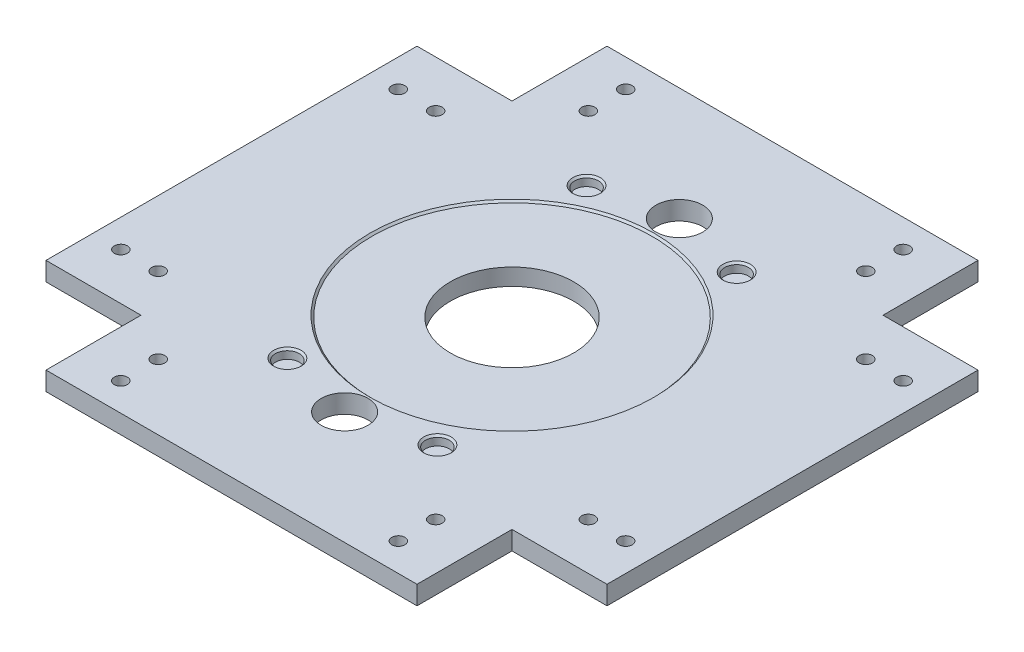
ISO-10303-21;
HEADER;
FILE_DESCRIPTION(('STEP AP214'),'2;1');
FILE_NAME('part.step','',(''),(''),'','','');
FILE_SCHEMA(('AUTOMOTIVE_DESIGN { 1 0 10303 214 1 1 1 1 }'));
ENDSEC;
DATA;
#1=APPLICATION_CONTEXT('core data for automotive mechanical design processes');
#2=APPLICATION_PROTOCOL_DEFINITION('international standard','automotive_design',2000,#1);
#3=PRODUCT_CONTEXT('',#1,'mechanical');
#4=PRODUCT('Part','Part','',(#3));
#5=PRODUCT_RELATED_PRODUCT_CATEGORY('part','',(#4));
#6=PRODUCT_DEFINITION_FORMATION('','',#4);
#7=PRODUCT_DEFINITION_CONTEXT('part definition',#1,'design');
#8=PRODUCT_DEFINITION('design','',#6,#7);
#9=PRODUCT_DEFINITION_SHAPE('','',#8);
#10=(LENGTH_UNIT() NAMED_UNIT(*) SI_UNIT(.MILLI.,.METRE.));
#11=(NAMED_UNIT(*) PLANE_ANGLE_UNIT() SI_UNIT($,.RADIAN.));
#12=(NAMED_UNIT(*) SI_UNIT($,.STERADIAN.) SOLID_ANGLE_UNIT());
#13=UNCERTAINTY_MEASURE_WITH_UNIT(LENGTH_MEASURE(1.E-05),#10,'distance_accuracy_value','');
#14=(GEOMETRIC_REPRESENTATION_CONTEXT(3) GLOBAL_UNCERTAINTY_ASSIGNED_CONTEXT((#13)) GLOBAL_UNIT_ASSIGNED_CONTEXT((#10,
#11,#12)) REPRESENTATION_CONTEXT('',''));
#15=CARTESIAN_POINT('',(0.,0.,0.));
#16=DIRECTION('',(0.,0.,1.));
#17=DIRECTION('',(1.,0.,0.));
#18=AXIS2_PLACEMENT_3D('',#15,#16,#17);
#19=CARTESIAN_POINT('',(0.,10.,0.));
#20=DIRECTION('',(0.,-1.,0.));
#21=DIRECTION('',(0.,0.,-1.));
#22=AXIS2_PLACEMENT_3D('',#19,#20,#21);
#23=CYLINDRICAL_SURFACE('',#22,33.);
#24=CARTESIAN_POINT('',(0.,0.,0.));
#25=DIRECTION('',(0.,1.,0.));
#26=DIRECTION('',(0.,0.,1.));
#27=AXIS2_PLACEMENT_3D('',#24,#25,#26);
#28=CIRCLE('',#27,33.);
#29=CARTESIAN_POINT('',(0.,0.,33.));
#30=VERTEX_POINT('',#29);
#31=EDGE_CURVE('E169',#30,#30,#28,.T.);
#32=ORIENTED_EDGE('',*,*,#31,.F.);
#33=EDGE_LOOP('',(#32));
#34=FACE_BOUND('',#33,.T.);
#35=CARTESIAN_POINT('',(0.,9.,0.));
#36=DIRECTION('',(0.,1.,0.));
#37=DIRECTION('',(0.,0.,1.));
#38=AXIS2_PLACEMENT_3D('',#35,#36,#37);
#39=CIRCLE('',#38,33.);
#40=CARTESIAN_POINT('',(0.,9.,33.));
#41=VERTEX_POINT('',#40);
#42=EDGE_CURVE('E237',#41,#41,#39,.T.);
#43=ORIENTED_EDGE('',*,*,#42,.T.);
#44=EDGE_LOOP('',(#43));
#45=FACE_BOUND('',#44,.T.);
#46=ADVANCED_FACE('F41',(#34,#45),#23,.F.);
#47=CARTESIAN_POINT('',(0.,10.,0.));
#48=DIRECTION('',(0.,-1.,0.));
#49=DIRECTION('',(0.,0.,-1.));
#50=AXIS2_PLACEMENT_3D('',#47,#48,#49);
#51=PLANE('',#50);
#52=CARTESIAN_POINT('',(-114.999999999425,10.,-74.1999999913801));
#53=DIRECTION('',(0.,1.,0.));
#54=DIRECTION('',(0.,0.,1.));
#55=AXIS2_PLACEMENT_3D('',#52,#53,#54);
#56=CIRCLE('',#55,3.49999999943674);
#57=CARTESIAN_POINT('',(-114.999999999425,10.,-70.6999999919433));
#58=VERTEX_POINT('',#57);
#59=EDGE_CURVE('E558',#58,#58,#56,.T.);
#60=ORIENTED_EDGE('',*,*,#59,.F.);
#61=EDGE_LOOP('',(#60));
#62=FACE_BOUND('',#61,.T.);
#63=CARTESIAN_POINT('',(-74.1999999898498,10.,-115.000000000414));
#64=DIRECTION('',(0.,1.,0.));
#65=DIRECTION('',(0.,0.,1.));
#66=AXIS2_PLACEMENT_3D('',#63,#64,#65);
#67=CIRCLE('',#66,3.49999999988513);
#68=CARTESIAN_POINT('',(-74.1999999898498,10.,-111.500000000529));
#69=VERTEX_POINT('',#68);
#70=EDGE_CURVE('E562',#69,#69,#67,.T.);
#71=ORIENTED_EDGE('',*,*,#70,.F.);
#72=EDGE_LOOP('',(#71));
#73=FACE_BOUND('',#72,.T.);
#74=CARTESIAN_POINT('',(74.1999999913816,10.,-114.99999999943));
#75=DIRECTION('',(0.,1.,0.));
#76=DIRECTION('',(0.,0.,1.));
#77=AXIS2_PLACEMENT_3D('',#74,#75,#76);
#78=CIRCLE('',#77,3.49999999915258);
#79=CARTESIAN_POINT('',(74.1999999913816,10.,-111.500000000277));
#80=VERTEX_POINT('',#79);
#81=EDGE_CURVE('E566',#80,#80,#78,.T.);
#82=ORIENTED_EDGE('',*,*,#81,.F.);
#83=EDGE_LOOP('',(#82));
#84=FACE_BOUND('',#83,.T.);
#85=CARTESIAN_POINT('',(74.1999999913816,10.,-134.99999999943));
#86=DIRECTION('',(0.,1.,0.));
#87=DIRECTION('',(0.,0.,1.));
#88=AXIS2_PLACEMENT_3D('',#85,#86,#87);
#89=CIRCLE('',#88,3.49999999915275);
#90=CARTESIAN_POINT('',(74.1999999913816,10.,-131.500000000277));
#91=VERTEX_POINT('',#90);
#92=EDGE_CURVE('E570',#91,#91,#89,.T.);
#93=ORIENTED_EDGE('',*,*,#92,.F.);
#94=EDGE_LOOP('',(#93));
#95=FACE_BOUND('',#94,.T.);
#96=CARTESIAN_POINT('',(115.000000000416,10.,-74.1999999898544));
#97=DIRECTION('',(0.,1.,0.));
#98=DIRECTION('',(0.,0.,1.));
#99=AXIS2_PLACEMENT_3D('',#96,#97,#98);
#100=CIRCLE('',#99,3.49999999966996);
#101=CARTESIAN_POINT('',(115.000000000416,10.,-70.6999999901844));
#102=VERTEX_POINT('',#101);
#103=EDGE_CURVE('E574',#102,#102,#100,.T.);
#104=ORIENTED_EDGE('',*,*,#103,.F.);
#105=EDGE_LOOP('',(#104));
#106=FACE_BOUND('',#105,.T.);
#107=CARTESIAN_POINT('',(135.000000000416,10.,-74.199999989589));
#108=DIRECTION('',(0.,1.,0.));
#109=DIRECTION('',(0.,0.,1.));
#110=AXIS2_PLACEMENT_3D('',#107,#108,#109);
#111=CIRCLE('',#110,3.49999999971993);
#112=CARTESIAN_POINT('',(135.000000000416,10.,-70.6999999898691));
#113=VERTEX_POINT('',#112);
#114=EDGE_CURVE('E530',#113,#113,#111,.T.);
#115=ORIENTED_EDGE('',*,*,#114,.F.);
#116=EDGE_LOOP('',(#115));
#117=FACE_BOUND('',#116,.T.);
#118=CARTESIAN_POINT('',(74.1999999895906,10.,135.000000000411));
#119=DIRECTION('',(0.,1.,0.));
#120=DIRECTION('',(0.,0.,1.));
#121=AXIS2_PLACEMENT_3D('',#118,#119,#120);
#122=CIRCLE('',#121,3.50000000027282);
#123=CARTESIAN_POINT('',(74.1999999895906,10.,138.500000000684));
#124=VERTEX_POINT('',#123);
#125=EDGE_CURVE('E527',#124,#124,#122,.T.);
#126=ORIENTED_EDGE('',*,*,#125,.F.);
#127=EDGE_LOOP('',(#126));
#128=FACE_BOUND('',#127,.T.);
#129=CARTESIAN_POINT('',(74.199999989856,10.,115.000000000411));
#130=DIRECTION('',(0.,1.,0.));
#131=DIRECTION('',(0.,0.,1.));
#132=AXIS2_PLACEMENT_3D('',#129,#130,#131);
#133=CIRCLE('',#132,3.50000000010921);
#134=CARTESIAN_POINT('',(74.199999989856,10.,118.50000000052));
#135=VERTEX_POINT('',#134);
#136=EDGE_CURVE('E532',#135,#135,#133,.T.);
#137=ORIENTED_EDGE('',*,*,#136,.F.);
#138=EDGE_LOOP('',(#137));
#139=FACE_BOUND('',#138,.T.);
#140=CARTESIAN_POINT('',(-74.1999999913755,10.,114.999999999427));
#141=DIRECTION('',(0.,1.,0.));
#142=DIRECTION('',(0.,0.,1.));
#143=AXIS2_PLACEMENT_3D('',#140,#141,#142);
#144=CIRCLE('',#143,3.50000000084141);
#145=CARTESIAN_POINT('',(-74.1999999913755,10.,118.500000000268));
#146=VERTEX_POINT('',#145);
#147=EDGE_CURVE('E538',#146,#146,#144,.T.);
#148=ORIENTED_EDGE('',*,*,#147,.F.);
#149=EDGE_LOOP('',(#148));
#150=FACE_BOUND('',#149,.T.);
#151=CARTESIAN_POINT('',(-74.1999999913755,10.,134.999999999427));
#152=DIRECTION('',(0.,1.,0.));
#153=DIRECTION('',(0.,0.,1.));
#154=AXIS2_PLACEMENT_3D('',#151,#152,#153);
#155=CIRCLE('',#154,3.50000000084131);
#156=CARTESIAN_POINT('',(-74.1999999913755,10.,138.500000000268));
#157=VERTEX_POINT('',#156);
#158=EDGE_CURVE('E542',#157,#157,#155,.T.);
#159=ORIENTED_EDGE('',*,*,#158,.F.);
#160=EDGE_LOOP('',(#159));
#161=FACE_BOUND('',#160,.T.);
#162=CARTESIAN_POINT('',(-115.000000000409,10.,74.1999999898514));
#163=DIRECTION('',(0.,1.,0.));
#164=DIRECTION('',(0.,0.,1.));
#165=AXIS2_PLACEMENT_3D('',#162,#163,#164);
#166=CIRCLE('',#165,3.50000000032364);
#167=CARTESIAN_POINT('',(-115.000000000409,10.,77.699999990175));
#168=VERTEX_POINT('',#167);
#169=EDGE_CURVE('E546',#168,#168,#166,.T.);
#170=ORIENTED_EDGE('',*,*,#169,.F.);
#171=EDGE_LOOP('',(#170));
#172=FACE_BOUND('',#171,.T.);
#173=CARTESIAN_POINT('',(-135.000000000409,10.,74.1999999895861));
#174=DIRECTION('',(0.,1.,0.));
#175=DIRECTION('',(0.,0.,1.));
#176=AXIS2_PLACEMENT_3D('',#173,#174,#175);
#177=CIRCLE('',#176,3.50000000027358);
#178=CARTESIAN_POINT('',(-135.000000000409,10.,77.6999999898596));
#179=VERTEX_POINT('',#178);
#180=EDGE_CURVE('E550',#179,#179,#177,.T.);
#181=ORIENTED_EDGE('',*,*,#180,.F.);
#182=EDGE_LOOP('',(#181));
#183=FACE_BOUND('',#182,.T.);
#184=CARTESIAN_POINT('',(-74.1999999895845,10.,-135.000000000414));
#185=DIRECTION('',(0.,1.,0.));
#186=DIRECTION('',(0.,0.,1.));
#187=AXIS2_PLACEMENT_3D('',#184,#185,#186);
#188=CIRCLE('',#187,3.49999999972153);
#189=CARTESIAN_POINT('',(-74.1999999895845,10.,-131.500000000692));
#190=VERTEX_POINT('',#189);
#191=EDGE_CURVE('E554',#190,#190,#188,.T.);
#192=ORIENTED_EDGE('',*,*,#191,.F.);
#193=EDGE_LOOP('',(#192));
#194=FACE_BOUND('',#193,.T.);
#195=CARTESIAN_POINT('',(-134.999999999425,10.,-74.1999999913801));
#196=DIRECTION('',(0.,1.,0.));
#197=DIRECTION('',(0.,0.,1.));
#198=AXIS2_PLACEMENT_3D('',#195,#196,#197);
#199=CIRCLE('',#198,3.4999999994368);
#200=CARTESIAN_POINT('',(-134.999999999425,10.,-70.6999999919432));
#201=VERTEX_POINT('',#200);
#202=EDGE_CURVE('E252',#201,#201,#199,.T.);
#203=ORIENTED_EDGE('',*,*,#202,.F.);
#204=EDGE_LOOP('',(#203));
#205=FACE_BOUND('',#204,.T.);
#206=CARTESIAN_POINT('',(0.,10.,0.));
#207=DIRECTION('',(0.,-1.,0.));
#208=DIRECTION('',(0.,0.,-1.));
#209=AXIS2_PLACEMENT_3D('',#206,#207,#208);
#210=CIRCLE('',#209,76.);
#211=CARTESIAN_POINT('',(0.,10.,-76.));
#212=VERTEX_POINT('',#211);
#213=EDGE_CURVE('E11',#212,#212,#210,.T.);
#214=ORIENTED_EDGE('',*,*,#213,.T.);
#215=EDGE_LOOP('',(#214));
#216=FACE_BOUND('',#215,.T.);
#217=CARTESIAN_POINT('',(40.1279204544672,10.,-79.9999999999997));
#218=DIRECTION('',(0.,-1.,0.));
#219=DIRECTION('',(0.,0.,-1.));
#220=AXIS2_PLACEMENT_3D('',#217,#218,#219);
#221=CIRCLE('',#220,7.34999999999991);
#222=CARTESIAN_POINT('',(40.1279204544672,10.,-87.3499999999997));
#223=VERTEX_POINT('',#222);
#224=EDGE_CURVE('E227',#223,#223,#221,.T.);
#225=ORIENTED_EDGE('',*,*,#224,.T.);
#226=EDGE_LOOP('',(#225));
#227=FACE_BOUND('',#226,.T.);
#228=CARTESIAN_POINT('',(-40.1279204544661,10.,-80.0000000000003));
#229=DIRECTION('',(0.,-1.,0.));
#230=DIRECTION('',(0.,0.,-1.));
#231=AXIS2_PLACEMENT_3D('',#228,#229,#230);
#232=CIRCLE('',#231,7.34999999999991);
#233=CARTESIAN_POINT('',(-40.1279204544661,10.,-87.3500000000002));
#234=VERTEX_POINT('',#233);
#235=EDGE_CURVE('E224',#234,#234,#232,.T.);
#236=ORIENTED_EDGE('',*,*,#235,.T.);
#237=EDGE_LOOP('',(#236));
#238=FACE_BOUND('',#237,.T.);
#239=CARTESIAN_POINT('',(40.1279204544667,10.,80.));
#240=DIRECTION('',(0.,-1.,0.));
#241=DIRECTION('',(0.,0.,-1.));
#242=AXIS2_PLACEMENT_3D('',#239,#240,#241);
#243=CIRCLE('',#242,7.34999999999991);
#244=CARTESIAN_POINT('',(40.1279204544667,10.,72.6500000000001));
#245=VERTEX_POINT('',#244);
#246=EDGE_CURVE('E221',#245,#245,#243,.T.);
#247=ORIENTED_EDGE('',*,*,#246,.T.);
#248=EDGE_LOOP('',(#247));
#249=FACE_BOUND('',#248,.T.);
#250=CARTESIAN_POINT('',(-40.1279204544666,10.,80.));
#251=DIRECTION('',(0.,-1.,0.));
#252=DIRECTION('',(0.,0.,-1.));
#253=AXIS2_PLACEMENT_3D('',#250,#251,#252);
#254=CIRCLE('',#253,7.34999999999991);
#255=CARTESIAN_POINT('',(-40.1279204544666,10.,72.6500000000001));
#256=VERTEX_POINT('',#255);
#257=EDGE_CURVE('E218',#256,#256,#254,.T.);
#258=ORIENTED_EDGE('',*,*,#257,.T.);
#259=EDGE_LOOP('',(#258));
#260=FACE_BOUND('',#259,.T.);
#261=CARTESIAN_POINT('',(134.999999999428,10.,74.1999999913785));
#262=DIRECTION('',(0.,1.,0.));
#263=DIRECTION('',(0.,0.,1.));
#264=AXIS2_PLACEMENT_3D('',#261,#262,#263);
#265=CIRCLE('',#264,3.50000000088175);
#266=CARTESIAN_POINT('',(134.999999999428,10.,77.6999999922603));
#267=VERTEX_POINT('',#266);
#268=EDGE_CURVE('E269',#267,#267,#265,.T.);
#269=ORIENTED_EDGE('',*,*,#268,.F.);
#270=EDGE_LOOP('',(#269));
#271=FACE_BOUND('',#270,.T.);
#272=CARTESIAN_POINT('',(114.999999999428,10.,74.1999999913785));
#273=DIRECTION('',(0.,1.,0.));
#274=DIRECTION('',(0.,0.,1.));
#275=AXIS2_PLACEMENT_3D('',#272,#273,#274);
#276=CIRCLE('',#275,3.50000000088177);
#277=CARTESIAN_POINT('',(114.999999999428,10.,77.6999999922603));
#278=VERTEX_POINT('',#277);
#279=EDGE_CURVE('E272',#278,#278,#276,.T.);
#280=ORIENTED_EDGE('',*,*,#279,.F.);
#281=EDGE_LOOP('',(#280));
#282=FACE_BOUND('',#281,.T.);
#283=DIRECTION('',(0.,0.,1.));
#284=VECTOR('',#283,1.);
#285=CARTESIAN_POINT('',(-99.2,10.,150.));
#286=LINE('',#285,#284);
#287=CARTESIAN_POINT('',(-99.2,10.,99.2000000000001));
#288=VERTEX_POINT('',#287);
#289=CARTESIAN_POINT('',(-99.2,10.,150.));
#290=VERTEX_POINT('',#289);
#291=EDGE_CURVE('E188',#288,#290,#286,.T.);
#292=ORIENTED_EDGE('',*,*,#291,.T.);
#293=DIRECTION('',(1.,0.,0.));
#294=VECTOR('',#293,1.);
#295=CARTESIAN_POINT('',(-99.2,10.,150.));
#296=LINE('',#295,#294);
#297=CARTESIAN_POINT('',(99.2,10.,150.));
#298=VERTEX_POINT('',#297);
#299=EDGE_CURVE('E115',#290,#298,#296,.T.);
#300=ORIENTED_EDGE('',*,*,#299,.T.);
#301=DIRECTION('',(0.,0.,-1.));
#302=VECTOR('',#301,1.);
#303=CARTESIAN_POINT('',(99.2,10.,150.));
#304=LINE('',#303,#302);
#305=CARTESIAN_POINT('',(99.2000000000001,10.,99.2));
#306=VERTEX_POINT('',#305);
#307=EDGE_CURVE('E292',#298,#306,#304,.T.);
#308=ORIENTED_EDGE('',*,*,#307,.T.);
#309=DIRECTION('',(1.,0.,0.));
#310=VECTOR('',#309,1.);
#311=CARTESIAN_POINT('',(150.,10.,99.2));
#312=LINE('',#311,#310);
#313=CARTESIAN_POINT('',(150.,10.,99.2));
#314=VERTEX_POINT('',#313);
#315=EDGE_CURVE('E294',#306,#314,#312,.T.);
#316=ORIENTED_EDGE('',*,*,#315,.T.);
#317=DIRECTION('',(0.,0.,-1.));
#318=VECTOR('',#317,1.);
#319=CARTESIAN_POINT('',(150.,10.,99.2));
#320=LINE('',#319,#318);
#321=CARTESIAN_POINT('',(150.,10.,-99.2));
#322=VERTEX_POINT('',#321);
#323=EDGE_CURVE('E296',#314,#322,#320,.T.);
#324=ORIENTED_EDGE('',*,*,#323,.T.);
#325=DIRECTION('',(-1.,0.,0.));
#326=VECTOR('',#325,1.);
#327=CARTESIAN_POINT('',(150.,10.,-99.2));
#328=LINE('',#327,#326);
#329=CARTESIAN_POINT('',(99.2,10.,-99.2));
#330=VERTEX_POINT('',#329);
#331=EDGE_CURVE('E298',#322,#330,#328,.T.);
#332=ORIENTED_EDGE('',*,*,#331,.T.);
#333=DIRECTION('',(0.,0.,-1.));
#334=VECTOR('',#333,1.);
#335=CARTESIAN_POINT('',(99.2000000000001,10.,-150.));
#336=LINE('',#335,#334);
#337=CARTESIAN_POINT('',(99.2000000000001,10.,-150.));
#338=VERTEX_POINT('',#337);
#339=EDGE_CURVE('E300',#330,#338,#336,.T.);
#340=ORIENTED_EDGE('',*,*,#339,.T.);
#341=DIRECTION('',(-1.,0.,0.));
#342=VECTOR('',#341,1.);
#343=CARTESIAN_POINT('',(-99.2,10.,-150.));
#344=LINE('',#343,#342);
#345=CARTESIAN_POINT('',(-99.2,10.,-150.));
#346=VERTEX_POINT('',#345);
#347=EDGE_CURVE('E302',#338,#346,#344,.T.);
#348=ORIENTED_EDGE('',*,*,#347,.T.);
#349=DIRECTION('',(0.,0.,1.));
#350=VECTOR('',#349,1.);
#351=CARTESIAN_POINT('',(-99.2,10.,-150.));
#352=LINE('',#351,#350);
#353=CARTESIAN_POINT('',(-99.2,10.,-99.2));
#354=VERTEX_POINT('',#353);
#355=EDGE_CURVE('E147',#346,#354,#352,.T.);
#356=ORIENTED_EDGE('',*,*,#355,.T.);
#357=DIRECTION('',(-1.,0.,0.));
#358=VECTOR('',#357,1.);
#359=CARTESIAN_POINT('',(-150.,10.,-99.2));
#360=LINE('',#359,#358);
#361=CARTESIAN_POINT('',(-150.,10.,-99.2));
#362=VERTEX_POINT('',#361);
#363=EDGE_CURVE('E140',#354,#362,#360,.T.);
#364=ORIENTED_EDGE('',*,*,#363,.T.);
#365=DIRECTION('',(0.,0.,1.));
#366=VECTOR('',#365,1.);
#367=CARTESIAN_POINT('',(-150.,10.,99.2000000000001));
#368=LINE('',#367,#366);
#369=CARTESIAN_POINT('',(-150.,10.,99.2000000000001));
#370=VERTEX_POINT('',#369);
#371=EDGE_CURVE('E145',#362,#370,#368,.T.);
#372=ORIENTED_EDGE('',*,*,#371,.T.);
#373=DIRECTION('',(1.,0.,0.));
#374=VECTOR('',#373,1.);
#375=CARTESIAN_POINT('',(-150.,10.,99.2000000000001));
#376=LINE('',#375,#374);
#377=EDGE_CURVE('E59',#370,#288,#376,.T.);
#378=ORIENTED_EDGE('',*,*,#377,.T.);
#379=EDGE_LOOP('',(#292,#300,#308,#316,#324,#332,#340,#348,#356,#364,#372,#378));
#380=FACE_BOUND('',#379,.T.);
#381=CARTESIAN_POINT('',(0.,10.,-89.5000000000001));
#382=DIRECTION('',(0.,1.,0.));
#383=DIRECTION('',(0.,0.,1.));
#384=AXIS2_PLACEMENT_3D('',#381,#382,#383);
#385=CIRCLE('',#384,12.5);
#386=CARTESIAN_POINT('',(0.,10.,-77.0000000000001));
#387=VERTEX_POINT('',#386);
#388=EDGE_CURVE('E283',#387,#387,#385,.T.);
#389=ORIENTED_EDGE('',*,*,#388,.F.);
#390=EDGE_LOOP('',(#389));
#391=FACE_BOUND('',#390,.T.);
#392=CARTESIAN_POINT('',(0.,10.,89.5));
#393=DIRECTION('',(0.,1.,0.));
#394=DIRECTION('',(0.,0.,1.));
#395=AXIS2_PLACEMENT_3D('',#392,#393,#394);
#396=CIRCLE('',#395,12.5);
#397=CARTESIAN_POINT('',(0.,10.,102.));
#398=VERTEX_POINT('',#397);
#399=EDGE_CURVE('E277',#398,#398,#396,.T.);
#400=ORIENTED_EDGE('',*,*,#399,.F.);
#401=EDGE_LOOP('',(#400));
#402=FACE_BOUND('',#401,.T.);
#403=ADVANCED_FACE('F142',(#62,#73,#84,#95,#106,#117,#128,#139,#150,#161,#172,#183,#194,#205,
#216,#227,#238,#249,#260,#271,#282,#380,#391,#402),#51,.F.);
#404=CARTESIAN_POINT('',(0.,0.,0.));
#405=DIRECTION('',(0.,-1.,0.));
#406=DIRECTION('',(0.,0.,-1.));
#407=AXIS2_PLACEMENT_3D('',#404,#405,#406);
#408=PLANE('',#407);
#409=CARTESIAN_POINT('',(-114.999999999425,0.,-74.1999999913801));
#410=DIRECTION('',(0.,1.,0.));
#411=DIRECTION('',(0.,0.,1.));
#412=AXIS2_PLACEMENT_3D('',#409,#410,#411);
#413=CIRCLE('',#412,3.49999999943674);
#414=CARTESIAN_POINT('',(-114.999999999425,0.,-70.6999999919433));
#415=VERTEX_POINT('',#414);
#416=EDGE_CURVE('E358',#415,#415,#413,.T.);
#417=ORIENTED_EDGE('',*,*,#416,.T.);
#418=EDGE_LOOP('',(#417));
#419=FACE_BOUND('',#418,.T.);
#420=CARTESIAN_POINT('',(-74.1999999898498,0.,-115.000000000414));
#421=DIRECTION('',(0.,1.,0.));
#422=DIRECTION('',(0.,0.,1.));
#423=AXIS2_PLACEMENT_3D('',#420,#421,#422);
#424=CIRCLE('',#423,3.49999999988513);
#425=CARTESIAN_POINT('',(-74.1999999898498,0.,-111.500000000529));
#426=VERTEX_POINT('',#425);
#427=EDGE_CURVE('E362',#426,#426,#424,.T.);
#428=ORIENTED_EDGE('',*,*,#427,.T.);
#429=EDGE_LOOP('',(#428));
#430=FACE_BOUND('',#429,.T.);
#431=CARTESIAN_POINT('',(74.1999999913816,0.,-114.99999999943));
#432=DIRECTION('',(0.,1.,0.));
#433=DIRECTION('',(0.,0.,1.));
#434=AXIS2_PLACEMENT_3D('',#431,#432,#433);
#435=CIRCLE('',#434,3.49999999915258);
#436=CARTESIAN_POINT('',(74.1999999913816,0.,-111.500000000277));
#437=VERTEX_POINT('',#436);
#438=EDGE_CURVE('E366',#437,#437,#435,.T.);
#439=ORIENTED_EDGE('',*,*,#438,.T.);
#440=EDGE_LOOP('',(#439));
#441=FACE_BOUND('',#440,.T.);
#442=CARTESIAN_POINT('',(74.1999999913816,0.,-134.99999999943));
#443=DIRECTION('',(0.,1.,0.));
#444=DIRECTION('',(0.,0.,1.));
#445=AXIS2_PLACEMENT_3D('',#442,#443,#444);
#446=CIRCLE('',#445,3.49999999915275);
#447=CARTESIAN_POINT('',(74.1999999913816,0.,-131.500000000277));
#448=VERTEX_POINT('',#447);
#449=EDGE_CURVE('E370',#448,#448,#446,.T.);
#450=ORIENTED_EDGE('',*,*,#449,.T.);
#451=EDGE_LOOP('',(#450));
#452=FACE_BOUND('',#451,.T.);
#453=CARTESIAN_POINT('',(115.000000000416,0.,-74.1999999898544));
#454=DIRECTION('',(0.,1.,0.));
#455=DIRECTION('',(0.,0.,1.));
#456=AXIS2_PLACEMENT_3D('',#453,#454,#455);
#457=CIRCLE('',#456,3.49999999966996);
#458=CARTESIAN_POINT('',(115.000000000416,0.,-70.6999999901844));
#459=VERTEX_POINT('',#458);
#460=EDGE_CURVE('E374',#459,#459,#457,.T.);
#461=ORIENTED_EDGE('',*,*,#460,.T.);
#462=EDGE_LOOP('',(#461));
#463=FACE_BOUND('',#462,.T.);
#464=CARTESIAN_POINT('',(135.000000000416,0.,-74.199999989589));
#465=DIRECTION('',(0.,1.,0.));
#466=DIRECTION('',(0.,0.,1.));
#467=AXIS2_PLACEMENT_3D('',#464,#465,#466);
#468=CIRCLE('',#467,3.49999999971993);
#469=CARTESIAN_POINT('',(135.000000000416,0.,-70.6999999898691));
#470=VERTEX_POINT('',#469);
#471=EDGE_CURVE('E378',#470,#470,#468,.T.);
#472=ORIENTED_EDGE('',*,*,#471,.T.);
#473=EDGE_LOOP('',(#472));
#474=FACE_BOUND('',#473,.T.);
#475=CARTESIAN_POINT('',(74.1999999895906,0.,135.000000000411));
#476=DIRECTION('',(0.,1.,0.));
#477=DIRECTION('',(0.,0.,1.));
#478=AXIS2_PLACEMENT_3D('',#475,#476,#477);
#479=CIRCLE('',#478,3.50000000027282);
#480=CARTESIAN_POINT('',(74.1999999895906,0.,138.500000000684));
#481=VERTEX_POINT('',#480);
#482=EDGE_CURVE('E382',#481,#481,#479,.T.);
#483=ORIENTED_EDGE('',*,*,#482,.T.);
#484=EDGE_LOOP('',(#483));
#485=FACE_BOUND('',#484,.T.);
#486=CARTESIAN_POINT('',(74.199999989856,0.,115.000000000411));
#487=DIRECTION('',(0.,1.,0.));
#488=DIRECTION('',(0.,0.,1.));
#489=AXIS2_PLACEMENT_3D('',#486,#487,#488);
#490=CIRCLE('',#489,3.50000000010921);
#491=CARTESIAN_POINT('',(74.199999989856,0.,118.50000000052));
#492=VERTEX_POINT('',#491);
#493=EDGE_CURVE('E386',#492,#492,#490,.T.);
#494=ORIENTED_EDGE('',*,*,#493,.T.);
#495=EDGE_LOOP('',(#494));
#496=FACE_BOUND('',#495,.T.);
#497=CARTESIAN_POINT('',(-74.1999999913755,0.,114.999999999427));
#498=DIRECTION('',(0.,1.,0.));
#499=DIRECTION('',(0.,0.,1.));
#500=AXIS2_PLACEMENT_3D('',#497,#498,#499);
#501=CIRCLE('',#500,3.50000000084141);
#502=CARTESIAN_POINT('',(-74.1999999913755,0.,118.500000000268));
#503=VERTEX_POINT('',#502);
#504=EDGE_CURVE('E390',#503,#503,#501,.T.);
#505=ORIENTED_EDGE('',*,*,#504,.T.);
#506=EDGE_LOOP('',(#505));
#507=FACE_BOUND('',#506,.T.);
#508=CARTESIAN_POINT('',(-74.1999999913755,0.,134.999999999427));
#509=DIRECTION('',(0.,1.,0.));
#510=DIRECTION('',(0.,0.,1.));
#511=AXIS2_PLACEMENT_3D('',#508,#509,#510);
#512=CIRCLE('',#511,3.50000000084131);
#513=CARTESIAN_POINT('',(-74.1999999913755,0.,138.500000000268));
#514=VERTEX_POINT('',#513);
#515=EDGE_CURVE('E394',#514,#514,#512,.T.);
#516=ORIENTED_EDGE('',*,*,#515,.T.);
#517=EDGE_LOOP('',(#516));
#518=FACE_BOUND('',#517,.T.);
#519=CARTESIAN_POINT('',(-115.000000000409,0.,74.1999999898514));
#520=DIRECTION('',(0.,1.,0.));
#521=DIRECTION('',(0.,0.,1.));
#522=AXIS2_PLACEMENT_3D('',#519,#520,#521);
#523=CIRCLE('',#522,3.50000000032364);
#524=CARTESIAN_POINT('',(-115.000000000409,0.,77.699999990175));
#525=VERTEX_POINT('',#524);
#526=EDGE_CURVE('E398',#525,#525,#523,.T.);
#527=ORIENTED_EDGE('',*,*,#526,.T.);
#528=EDGE_LOOP('',(#527));
#529=FACE_BOUND('',#528,.T.);
#530=CARTESIAN_POINT('',(-135.000000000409,0.,74.1999999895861));
#531=DIRECTION('',(0.,1.,0.));
#532=DIRECTION('',(0.,0.,1.));
#533=AXIS2_PLACEMENT_3D('',#530,#531,#532);
#534=CIRCLE('',#533,3.50000000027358);
#535=CARTESIAN_POINT('',(-135.000000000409,0.,77.6999999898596));
#536=VERTEX_POINT('',#535);
#537=EDGE_CURVE('E402',#536,#536,#534,.T.);
#538=ORIENTED_EDGE('',*,*,#537,.T.);
#539=EDGE_LOOP('',(#538));
#540=FACE_BOUND('',#539,.T.);
#541=CARTESIAN_POINT('',(-74.1999999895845,0.,-135.000000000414));
#542=DIRECTION('',(0.,1.,0.));
#543=DIRECTION('',(0.,0.,1.));
#544=AXIS2_PLACEMENT_3D('',#541,#542,#543);
#545=CIRCLE('',#544,3.49999999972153);
#546=CARTESIAN_POINT('',(-74.1999999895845,0.,-131.500000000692));
#547=VERTEX_POINT('',#546);
#548=EDGE_CURVE('E406',#547,#547,#545,.T.);
#549=ORIENTED_EDGE('',*,*,#548,.T.);
#550=EDGE_LOOP('',(#549));
#551=FACE_BOUND('',#550,.T.);
#552=CARTESIAN_POINT('',(-134.999999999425,0.,-74.1999999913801));
#553=DIRECTION('',(0.,1.,0.));
#554=DIRECTION('',(0.,0.,1.));
#555=AXIS2_PLACEMENT_3D('',#552,#553,#554);
#556=CIRCLE('',#555,3.4999999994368);
#557=CARTESIAN_POINT('',(-134.999999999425,0.,-70.6999999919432));
#558=VERTEX_POINT('',#557);
#559=EDGE_CURVE('E247',#558,#558,#556,.T.);
#560=ORIENTED_EDGE('',*,*,#559,.T.);
#561=EDGE_LOOP('',(#560));
#562=FACE_BOUND('',#561,.T.);
#563=CARTESIAN_POINT('',(134.999999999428,0.,74.1999999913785));
#564=DIRECTION('',(0.,1.,0.));
#565=DIRECTION('',(0.,0.,1.));
#566=AXIS2_PLACEMENT_3D('',#563,#564,#565);
#567=CIRCLE('',#566,3.50000000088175);
#568=CARTESIAN_POINT('',(134.999999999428,0.,77.6999999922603));
#569=VERTEX_POINT('',#568);
#570=EDGE_CURVE('E265',#569,#569,#567,.T.);
#571=ORIENTED_EDGE('',*,*,#570,.T.);
#572=EDGE_LOOP('',(#571));
#573=FACE_BOUND('',#572,.T.);
#574=CARTESIAN_POINT('',(114.999999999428,0.,74.1999999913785));
#575=DIRECTION('',(0.,1.,0.));
#576=DIRECTION('',(0.,0.,1.));
#577=AXIS2_PLACEMENT_3D('',#574,#575,#576);
#578=CIRCLE('',#577,3.50000000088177);
#579=CARTESIAN_POINT('',(114.999999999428,0.,77.6999999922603));
#580=VERTEX_POINT('',#579);
#581=EDGE_CURVE('E264',#580,#580,#578,.T.);
#582=ORIENTED_EDGE('',*,*,#581,.T.);
#583=EDGE_LOOP('',(#582));
#584=FACE_BOUND('',#583,.T.);
#585=CARTESIAN_POINT('',(0.,0.,-89.5000000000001));
#586=DIRECTION('',(0.,1.,0.));
#587=DIRECTION('',(0.,0.,1.));
#588=AXIS2_PLACEMENT_3D('',#585,#586,#587);
#589=CIRCLE('',#588,12.5);
#590=CARTESIAN_POINT('',(0.,0.,-77.0000000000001));
#591=VERTEX_POINT('',#590);
#592=EDGE_CURVE('E280',#591,#591,#589,.T.);
#593=ORIENTED_EDGE('',*,*,#592,.T.);
#594=EDGE_LOOP('',(#593));
#595=FACE_BOUND('',#594,.T.);
#596=DIRECTION('',(0.,0.,1.));
#597=VECTOR('',#596,1.);
#598=CARTESIAN_POINT('',(-99.2,0.,150.));
#599=LINE('',#598,#597);
#600=CARTESIAN_POINT('',(-99.2,0.,99.2000000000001));
#601=VERTEX_POINT('',#600);
#602=CARTESIAN_POINT('',(-99.2,0.,150.));
#603=VERTEX_POINT('',#602);
#604=EDGE_CURVE('E165',#601,#603,#599,.T.);
#605=ORIENTED_EDGE('',*,*,#604,.F.);
#606=DIRECTION('',(1.,0.,0.));
#607=VECTOR('',#606,1.);
#608=CARTESIAN_POINT('',(-150.,0.,99.2000000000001));
#609=LINE('',#608,#607);
#610=CARTESIAN_POINT('',(-150.,0.,99.2000000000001));
#611=VERTEX_POINT('',#610);
#612=EDGE_CURVE('E106',#611,#601,#609,.T.);
#613=ORIENTED_EDGE('',*,*,#612,.F.);
#614=DIRECTION('',(0.,0.,1.));
#615=VECTOR('',#614,1.);
#616=CARTESIAN_POINT('',(-150.,0.,99.2000000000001));
#617=LINE('',#616,#615);
#618=CARTESIAN_POINT('',(-150.,0.,-99.2));
#619=VERTEX_POINT('',#618);
#620=EDGE_CURVE('E100',#619,#611,#617,.T.);
#621=ORIENTED_EDGE('',*,*,#620,.F.);
#622=DIRECTION('',(-1.,0.,0.));
#623=VECTOR('',#622,1.);
#624=CARTESIAN_POINT('',(-150.,0.,-99.2));
#625=LINE('',#624,#623);
#626=CARTESIAN_POINT('',(-99.2,0.,-99.2));
#627=VERTEX_POINT('',#626);
#628=EDGE_CURVE('E155',#627,#619,#625,.T.);
#629=ORIENTED_EDGE('',*,*,#628,.F.);
#630=DIRECTION('',(0.,0.,1.));
#631=VECTOR('',#630,1.);
#632=CARTESIAN_POINT('',(-99.2,0.,-150.));
#633=LINE('',#632,#631);
#634=CARTESIAN_POINT('',(-99.2,0.,-150.));
#635=VERTEX_POINT('',#634);
#636=EDGE_CURVE('E183',#635,#627,#633,.T.);
#637=ORIENTED_EDGE('',*,*,#636,.F.);
#638=DIRECTION('',(-1.,0.,0.));
#639=VECTOR('',#638,1.);
#640=CARTESIAN_POINT('',(-99.2,0.,-150.));
#641=LINE('',#640,#639);
#642=CARTESIAN_POINT('',(99.2000000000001,0.,-150.));
#643=VERTEX_POINT('',#642);
#644=EDGE_CURVE('E181',#643,#635,#641,.T.);
#645=ORIENTED_EDGE('',*,*,#644,.F.);
#646=DIRECTION('',(0.,0.,-1.));
#647=VECTOR('',#646,1.);
#648=CARTESIAN_POINT('',(99.2000000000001,0.,-150.));
#649=LINE('',#648,#647);
#650=CARTESIAN_POINT('',(99.2,0.,-99.2));
#651=VERTEX_POINT('',#650);
#652=EDGE_CURVE('E179',#651,#643,#649,.T.);
#653=ORIENTED_EDGE('',*,*,#652,.F.);
#654=DIRECTION('',(-1.,0.,0.));
#655=VECTOR('',#654,1.);
#656=CARTESIAN_POINT('',(150.,0.,-99.2));
#657=LINE('',#656,#655);
#658=CARTESIAN_POINT('',(150.,0.,-99.2));
#659=VERTEX_POINT('',#658);
#660=EDGE_CURVE('E177',#659,#651,#657,.T.);
#661=ORIENTED_EDGE('',*,*,#660,.F.);
#662=DIRECTION('',(0.,0.,-1.));
#663=VECTOR('',#662,1.);
#664=CARTESIAN_POINT('',(150.,0.,99.2));
#665=LINE('',#664,#663);
#666=CARTESIAN_POINT('',(150.,0.,99.2));
#667=VERTEX_POINT('',#666);
#668=EDGE_CURVE('E175',#667,#659,#665,.T.);
#669=ORIENTED_EDGE('',*,*,#668,.F.);
#670=DIRECTION('',(1.,0.,0.));
#671=VECTOR('',#670,1.);
#672=CARTESIAN_POINT('',(150.,0.,99.2));
#673=LINE('',#672,#671);
#674=CARTESIAN_POINT('',(99.2000000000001,0.,99.2));
#675=VERTEX_POINT('',#674);
#676=EDGE_CURVE('E173',#675,#667,#673,.T.);
#677=ORIENTED_EDGE('',*,*,#676,.F.);
#678=DIRECTION('',(0.,0.,-1.));
#679=VECTOR('',#678,1.);
#680=CARTESIAN_POINT('',(99.2,0.,150.));
#681=LINE('',#680,#679);
#682=CARTESIAN_POINT('',(99.2,0.,150.));
#683=VERTEX_POINT('',#682);
#684=EDGE_CURVE('E171',#683,#675,#681,.T.);
#685=ORIENTED_EDGE('',*,*,#684,.F.);
#686=DIRECTION('',(1.,0.,0.));
#687=VECTOR('',#686,1.);
#688=CARTESIAN_POINT('',(-99.2,0.,150.));
#689=LINE('',#688,#687);
#690=EDGE_CURVE('E168',#603,#683,#689,.T.);
#691=ORIENTED_EDGE('',*,*,#690,.F.);
#692=EDGE_LOOP('',(#605,#613,#621,#629,#637,#645,#653,#661,#669,#677,#685,#691));
#693=FACE_BOUND('',#692,.T.);
#694=ORIENTED_EDGE('',*,*,#31,.T.);
#695=EDGE_LOOP('',(#694));
#696=FACE_BOUND('',#695,.T.);
#697=CARTESIAN_POINT('',(0.,0.,89.5));
#698=DIRECTION('',(0.,1.,0.));
#699=DIRECTION('',(0.,0.,1.));
#700=AXIS2_PLACEMENT_3D('',#697,#698,#699);
#701=CIRCLE('',#700,12.5);
#702=CARTESIAN_POINT('',(0.,0.,102.));
#703=VERTEX_POINT('',#702);
#704=EDGE_CURVE('E268',#703,#703,#701,.T.);
#705=ORIENTED_EDGE('',*,*,#704,.T.);
#706=EDGE_LOOP('',(#705));
#707=FACE_BOUND('',#706,.T.);
#708=ADVANCED_FACE('F315',(#419,#430,#441,#452,#463,#474,#485,#496,#507,#518,#529,#540,#551,
#562,#573,#584,#595,#693,#696,#707),#408,.T.);
#709=CARTESIAN_POINT('',(-99.2,10.,150.));
#710=DIRECTION('',(1.,0.,0.));
#711=DIRECTION('',(0.,0.,-1.));
#712=AXIS2_PLACEMENT_3D('',#709,#710,#711);
#713=PLANE('',#712);
#714=ORIENTED_EDGE('',*,*,#604,.T.);
#715=DIRECTION('',(0.,-1.,0.));
#716=VECTOR('',#715,1.);
#717=CARTESIAN_POINT('',(-99.2,10.,150.));
#718=LINE('',#717,#716);
#719=EDGE_CURVE('E213',#290,#603,#718,.T.);
#720=ORIENTED_EDGE('',*,*,#719,.F.);
#721=ORIENTED_EDGE('',*,*,#291,.F.);
#722=DIRECTION('',(0.,-1.,0.));
#723=VECTOR('',#722,1.);
#724=CARTESIAN_POINT('',(-99.2,10.,99.2000000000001));
#725=LINE('',#724,#723);
#726=EDGE_CURVE('E161',#288,#601,#725,.T.);
#727=ORIENTED_EDGE('',*,*,#726,.T.);
#728=EDGE_LOOP('',(#714,#720,#721,#727));
#729=FACE_BOUND('',#728,.T.);
#730=ADVANCED_FACE('F320',(#729),#713,.F.);
#731=CARTESIAN_POINT('',(-99.2,10.,150.));
#732=DIRECTION('',(0.,0.,-1.));
#733=DIRECTION('',(-1.,0.,0.));
#734=AXIS2_PLACEMENT_3D('',#731,#732,#733);
#735=PLANE('',#734);
#736=ORIENTED_EDGE('',*,*,#690,.T.);
#737=DIRECTION('',(0.,-1.,0.));
#738=VECTOR('',#737,1.);
#739=CARTESIAN_POINT('',(99.2,10.,150.));
#740=LINE('',#739,#738);
#741=EDGE_CURVE('E210',#298,#683,#740,.T.);
#742=ORIENTED_EDGE('',*,*,#741,.F.);
#743=ORIENTED_EDGE('',*,*,#299,.F.);
#744=ORIENTED_EDGE('',*,*,#719,.T.);
#745=EDGE_LOOP('',(#736,#742,#743,#744));
#746=FACE_BOUND('',#745,.T.);
#747=ADVANCED_FACE('F353',(#746),#735,.F.);
#748=CARTESIAN_POINT('',(99.2,10.,150.));
#749=DIRECTION('',(-1.,0.,0.));
#750=DIRECTION('',(0.,0.,1.));
#751=AXIS2_PLACEMENT_3D('',#748,#749,#750);
#752=PLANE('',#751);
#753=ORIENTED_EDGE('',*,*,#684,.T.);
#754=DIRECTION('',(0.,-1.,0.));
#755=VECTOR('',#754,1.);
#756=CARTESIAN_POINT('',(99.2000000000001,10.,99.2));
#757=LINE('',#756,#755);
#758=EDGE_CURVE('E207',#306,#675,#757,.T.);
#759=ORIENTED_EDGE('',*,*,#758,.F.);
#760=ORIENTED_EDGE('',*,*,#307,.F.);
#761=ORIENTED_EDGE('',*,*,#741,.T.);
#762=EDGE_LOOP('',(#753,#759,#760,#761));
#763=FACE_BOUND('',#762,.T.);
#764=ADVANCED_FACE('F643',(#763),#752,.F.);
#765=CARTESIAN_POINT('',(150.,10.,99.2));
#766=DIRECTION('',(0.,0.,-1.));
#767=DIRECTION('',(-1.,0.,0.));
#768=AXIS2_PLACEMENT_3D('',#765,#766,#767);
#769=PLANE('',#768);
#770=ORIENTED_EDGE('',*,*,#676,.T.);
#771=DIRECTION('',(0.,-1.,0.));
#772=VECTOR('',#771,1.);
#773=CARTESIAN_POINT('',(150.,10.,99.2));
#774=LINE('',#773,#772);
#775=EDGE_CURVE('E204',#314,#667,#774,.T.);
#776=ORIENTED_EDGE('',*,*,#775,.F.);
#777=ORIENTED_EDGE('',*,*,#315,.F.);
#778=ORIENTED_EDGE('',*,*,#758,.T.);
#779=EDGE_LOOP('',(#770,#776,#777,#778));
#780=FACE_BOUND('',#779,.T.);
#781=ADVANCED_FACE('F646',(#780),#769,.F.);
#782=CARTESIAN_POINT('',(150.,10.,99.2));
#783=DIRECTION('',(-1.,0.,0.));
#784=DIRECTION('',(0.,0.,1.));
#785=AXIS2_PLACEMENT_3D('',#782,#783,#784);
#786=PLANE('',#785);
#787=ORIENTED_EDGE('',*,*,#668,.T.);
#788=DIRECTION('',(0.,-1.,0.));
#789=VECTOR('',#788,1.);
#790=CARTESIAN_POINT('',(150.,10.,-99.2));
#791=LINE('',#790,#789);
#792=EDGE_CURVE('E201',#322,#659,#791,.T.);
#793=ORIENTED_EDGE('',*,*,#792,.F.);
#794=ORIENTED_EDGE('',*,*,#323,.F.);
#795=ORIENTED_EDGE('',*,*,#775,.T.);
#796=EDGE_LOOP('',(#787,#793,#794,#795));
#797=FACE_BOUND('',#796,.T.);
#798=ADVANCED_FACE('F650',(#797),#786,.F.);
#799=CARTESIAN_POINT('',(150.,10.,-99.2));
#800=DIRECTION('',(0.,0.,1.));
#801=DIRECTION('',(1.,0.,0.));
#802=AXIS2_PLACEMENT_3D('',#799,#800,#801);
#803=PLANE('',#802);
#804=ORIENTED_EDGE('',*,*,#660,.T.);
#805=DIRECTION('',(0.,-1.,0.));
#806=VECTOR('',#805,1.);
#807=CARTESIAN_POINT('',(99.2,10.,-99.2));
#808=LINE('',#807,#806);
#809=EDGE_CURVE('E198',#330,#651,#808,.T.);
#810=ORIENTED_EDGE('',*,*,#809,.F.);
#811=ORIENTED_EDGE('',*,*,#331,.F.);
#812=ORIENTED_EDGE('',*,*,#792,.T.);
#813=EDGE_LOOP('',(#804,#810,#811,#812));
#814=FACE_BOUND('',#813,.T.);
#815=ADVANCED_FACE('F654',(#814),#803,.F.);
#816=CARTESIAN_POINT('',(99.2000000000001,10.,-150.));
#817=DIRECTION('',(-1.,0.,0.));
#818=DIRECTION('',(0.,0.,1.));
#819=AXIS2_PLACEMENT_3D('',#816,#817,#818);
#820=PLANE('',#819);
#821=ORIENTED_EDGE('',*,*,#652,.T.);
#822=DIRECTION('',(0.,-1.,0.));
#823=VECTOR('',#822,1.);
#824=CARTESIAN_POINT('',(99.2000000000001,10.,-150.));
#825=LINE('',#824,#823);
#826=EDGE_CURVE('E195',#338,#643,#825,.T.);
#827=ORIENTED_EDGE('',*,*,#826,.F.);
#828=ORIENTED_EDGE('',*,*,#339,.F.);
#829=ORIENTED_EDGE('',*,*,#809,.T.);
#830=EDGE_LOOP('',(#821,#827,#828,#829));
#831=FACE_BOUND('',#830,.T.);
#832=ADVANCED_FACE('F658',(#831),#820,.F.);
#833=CARTESIAN_POINT('',(-99.2,10.,-150.));
#834=DIRECTION('',(0.,0.,1.));
#835=DIRECTION('',(1.,0.,0.));
#836=AXIS2_PLACEMENT_3D('',#833,#834,#835);
#837=PLANE('',#836);
#838=ORIENTED_EDGE('',*,*,#644,.T.);
#839=DIRECTION('',(0.,-1.,0.));
#840=VECTOR('',#839,1.);
#841=CARTESIAN_POINT('',(-99.2,10.,-150.));
#842=LINE('',#841,#840);
#843=EDGE_CURVE('E192',#346,#635,#842,.T.);
#844=ORIENTED_EDGE('',*,*,#843,.F.);
#845=ORIENTED_EDGE('',*,*,#347,.F.);
#846=ORIENTED_EDGE('',*,*,#826,.T.);
#847=EDGE_LOOP('',(#838,#844,#845,#846));
#848=FACE_BOUND('',#847,.T.);
#849=ADVANCED_FACE('F308',(#848),#837,.F.);
#850=CARTESIAN_POINT('',(-99.2,10.,-150.));
#851=DIRECTION('',(1.,0.,0.));
#852=DIRECTION('',(0.,0.,-1.));
#853=AXIS2_PLACEMENT_3D('',#850,#851,#852);
#854=PLANE('',#853);
#855=ORIENTED_EDGE('',*,*,#636,.T.);
#856=DIRECTION('',(0.,-1.,0.));
#857=VECTOR('',#856,1.);
#858=CARTESIAN_POINT('',(-99.2,10.,-99.2));
#859=LINE('',#858,#857);
#860=EDGE_CURVE('E156',#354,#627,#859,.T.);
#861=ORIENTED_EDGE('',*,*,#860,.F.);
#862=ORIENTED_EDGE('',*,*,#355,.F.);
#863=ORIENTED_EDGE('',*,*,#843,.T.);
#864=EDGE_LOOP('',(#855,#861,#862,#863));
#865=FACE_BOUND('',#864,.T.);
#866=ADVANCED_FACE('F312',(#865),#854,.F.);
#867=CARTESIAN_POINT('',(-150.,10.,-99.2));
#868=DIRECTION('',(0.,0.,1.));
#869=DIRECTION('',(1.,0.,0.));
#870=AXIS2_PLACEMENT_3D('',#867,#868,#869);
#871=PLANE('',#870);
#872=ORIENTED_EDGE('',*,*,#628,.T.);
#873=DIRECTION('',(0.,-1.,0.));
#874=VECTOR('',#873,1.);
#875=CARTESIAN_POINT('',(-150.,10.,-99.2));
#876=LINE('',#875,#874);
#877=EDGE_CURVE('E152',#362,#619,#876,.T.);
#878=ORIENTED_EDGE('',*,*,#877,.F.);
#879=ORIENTED_EDGE('',*,*,#363,.F.);
#880=ORIENTED_EDGE('',*,*,#860,.T.);
#881=EDGE_LOOP('',(#872,#878,#879,#880));
#882=FACE_BOUND('',#881,.T.);
#883=ADVANCED_FACE('F153',(#882),#871,.F.);
#884=CARTESIAN_POINT('',(-150.,10.,99.2000000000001));
#885=DIRECTION('',(1.,0.,0.));
#886=DIRECTION('',(0.,0.,-1.));
#887=AXIS2_PLACEMENT_3D('',#884,#885,#886);
#888=PLANE('',#887);
#889=ORIENTED_EDGE('',*,*,#620,.T.);
#890=DIRECTION('',(0.,-1.,0.));
#891=VECTOR('',#890,1.);
#892=CARTESIAN_POINT('',(-150.,10.,99.2000000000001));
#893=LINE('',#892,#891);
#894=EDGE_CURVE('E157',#370,#611,#893,.T.);
#895=ORIENTED_EDGE('',*,*,#894,.F.);
#896=ORIENTED_EDGE('',*,*,#371,.F.);
#897=ORIENTED_EDGE('',*,*,#877,.T.);
#898=EDGE_LOOP('',(#889,#895,#896,#897));
#899=FACE_BOUND('',#898,.T.);
#900=ADVANCED_FACE('F159',(#899),#888,.F.);
#901=CARTESIAN_POINT('',(-150.,10.,99.2000000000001));
#902=DIRECTION('',(0.,0.,-1.));
#903=DIRECTION('',(-1.,0.,0.));
#904=AXIS2_PLACEMENT_3D('',#901,#902,#903);
#905=PLANE('',#904);
#906=ORIENTED_EDGE('',*,*,#612,.T.);
#907=ORIENTED_EDGE('',*,*,#726,.F.);
#908=ORIENTED_EDGE('',*,*,#377,.F.);
#909=ORIENTED_EDGE('',*,*,#894,.T.);
#910=EDGE_LOOP('',(#906,#907,#908,#909));
#911=FACE_BOUND('',#910,.T.);
#912=ADVANCED_FACE('F322',(#911),#905,.F.);
#913=CARTESIAN_POINT('',(0.,10.,-89.5000000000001));
#914=DIRECTION('',(0.,-1.,0.));
#915=DIRECTION('',(0.,0.,-1.));
#916=AXIS2_PLACEMENT_3D('',#913,#914,#915);
#917=CYLINDRICAL_SURFACE('',#916,12.5);
#918=ORIENTED_EDGE('',*,*,#388,.T.);
#919=EDGE_LOOP('',(#918));
#920=FACE_BOUND('',#919,.T.);
#921=ORIENTED_EDGE('',*,*,#592,.F.);
#922=EDGE_LOOP('',(#921));
#923=FACE_BOUND('',#922,.T.);
#924=ADVANCED_FACE('F324',(#920,#923),#917,.F.);
#925=CARTESIAN_POINT('',(0.,10.,89.5));
#926=DIRECTION('',(0.,-1.,0.));
#927=DIRECTION('',(0.,0.,-1.));
#928=AXIS2_PLACEMENT_3D('',#925,#926,#927);
#929=CYLINDRICAL_SURFACE('',#928,12.5);
#930=ORIENTED_EDGE('',*,*,#399,.T.);
#931=EDGE_LOOP('',(#930));
#932=FACE_BOUND('',#931,.T.);
#933=ORIENTED_EDGE('',*,*,#704,.F.);
#934=EDGE_LOOP('',(#933));
#935=FACE_BOUND('',#934,.T.);
#936=ADVANCED_FACE('F330',(#932,#935),#929,.F.);
#937=CARTESIAN_POINT('',(114.999999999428,0.,74.1999999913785));
#938=DIRECTION('',(0.,1.,0.));
#939=DIRECTION('',(0.,0.,1.));
#940=AXIS2_PLACEMENT_3D('',#937,#938,#939);
#941=CYLINDRICAL_SURFACE('',#940,3.50000000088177);
#942=ORIENTED_EDGE('',*,*,#581,.F.);
#943=EDGE_LOOP('',(#942));
#944=FACE_BOUND('',#943,.T.);
#945=ORIENTED_EDGE('',*,*,#279,.T.);
#946=EDGE_LOOP('',(#945));
#947=FACE_BOUND('',#946,.T.);
#948=ADVANCED_FACE('F416',(#944,#947),#941,.F.);
#949=CARTESIAN_POINT('',(134.999999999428,0.,74.1999999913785));
#950=DIRECTION('',(0.,1.,0.));
#951=DIRECTION('',(0.,0.,1.));
#952=AXIS2_PLACEMENT_3D('',#949,#950,#951);
#953=CYLINDRICAL_SURFACE('',#952,3.50000000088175);
#954=ORIENTED_EDGE('',*,*,#570,.F.);
#955=EDGE_LOOP('',(#954));
#956=FACE_BOUND('',#955,.T.);
#957=ORIENTED_EDGE('',*,*,#268,.T.);
#958=EDGE_LOOP('',(#957));
#959=FACE_BOUND('',#958,.T.);
#960=ADVANCED_FACE('F419',(#956,#959),#953,.F.);
#961=CARTESIAN_POINT('',(-40.1279204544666,5.,80.));
#962=DIRECTION('',(0.,1.,0.));
#963=DIRECTION('',(0.,0.,1.));
#964=AXIS2_PLACEMENT_3D('',#961,#962,#963);
#965=CYLINDRICAL_SURFACE('',#964,6.35);
#966=CARTESIAN_POINT('',(-40.1279204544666,9.00000000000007,80.));
#967=DIRECTION('',(0.,-1.,0.));
#968=DIRECTION('',(0.,0.,-1.));
#969=AXIS2_PLACEMENT_3D('',#966,#967,#968);
#970=CIRCLE('',#969,6.35);
#971=CARTESIAN_POINT('',(-40.1279204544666,9.00000000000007,73.65));
#972=VERTEX_POINT('',#971);
#973=EDGE_CURVE('E51',#972,#972,#970,.F.);
#974=ORIENTED_EDGE('',*,*,#973,.T.);
#975=EDGE_LOOP('',(#974));
#976=FACE_BOUND('',#975,.T.);
#977=CARTESIAN_POINT('',(-40.1279204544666,5.,80.));
#978=DIRECTION('',(0.,1.,0.));
#979=DIRECTION('',(0.,0.,1.));
#980=AXIS2_PLACEMENT_3D('',#977,#978,#979);
#981=CIRCLE('',#980,6.35);
#982=CARTESIAN_POINT('',(-40.1279204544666,5.,86.35));
#983=VERTEX_POINT('',#982);
#984=EDGE_CURVE('E259',#983,#983,#981,.T.);
#985=ORIENTED_EDGE('',*,*,#984,.F.);
#986=EDGE_LOOP('',(#985));
#987=FACE_BOUND('',#986,.T.);
#988=ADVANCED_FACE('F427',(#976,#987),#965,.F.);
#989=CARTESIAN_POINT('',(-40.1279204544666,5.,80.));
#990=DIRECTION('',(0.,1.,0.));
#991=DIRECTION('',(0.,0.,1.));
#992=AXIS2_PLACEMENT_3D('',#989,#990,#991);
#993=PLANE('',#992);
#994=ORIENTED_EDGE('',*,*,#984,.T.);
#995=EDGE_LOOP('',(#994));
#996=FACE_BOUND('',#995,.T.);
#997=ADVANCED_FACE('F434',(#996),#993,.T.);
#998=CARTESIAN_POINT('',(40.1279204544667,5.,80.));
#999=DIRECTION('',(0.,1.,0.));
#1000=DIRECTION('',(0.,0.,1.));
#1001=AXIS2_PLACEMENT_3D('',#998,#999,#1000);
#1002=CYLINDRICAL_SURFACE('',#1001,6.35);
#1003=CARTESIAN_POINT('',(40.1279204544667,9.00000000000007,80.));
#1004=DIRECTION('',(0.,-1.,0.));
#1005=DIRECTION('',(0.,0.,-1.));
#1006=AXIS2_PLACEMENT_3D('',#1003,#1004,#1005);
#1007=CIRCLE('',#1006,6.35);
#1008=CARTESIAN_POINT('',(40.1279204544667,9.00000000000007,73.65));
#1009=VERTEX_POINT('',#1008);
#1010=EDGE_CURVE('E233',#1009,#1009,#1007,.F.);
#1011=ORIENTED_EDGE('',*,*,#1010,.T.);
#1012=EDGE_LOOP('',(#1011));
#1013=FACE_BOUND('',#1012,.T.);
#1014=CARTESIAN_POINT('',(40.1279204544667,5.,80.));
#1015=DIRECTION('',(0.,1.,0.));
#1016=DIRECTION('',(0.,0.,1.));
#1017=AXIS2_PLACEMENT_3D('',#1014,#1015,#1016);
#1018=CIRCLE('',#1017,6.35);
#1019=CARTESIAN_POINT('',(40.1279204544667,5.,86.35));
#1020=VERTEX_POINT('',#1019);
#1021=EDGE_CURVE('E256',#1020,#1020,#1018,.T.);
#1022=ORIENTED_EDGE('',*,*,#1021,.F.);
#1023=EDGE_LOOP('',(#1022));
#1024=FACE_BOUND('',#1023,.T.);
#1025=ADVANCED_FACE('F438',(#1013,#1024),#1002,.F.);
#1026=CARTESIAN_POINT('',(40.1279204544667,5.,80.));
#1027=DIRECTION('',(0.,1.,0.));
#1028=DIRECTION('',(0.,0.,1.));
#1029=AXIS2_PLACEMENT_3D('',#1026,#1027,#1028);
#1030=PLANE('',#1029);
#1031=ORIENTED_EDGE('',*,*,#1021,.T.);
#1032=EDGE_LOOP('',(#1031));
#1033=FACE_BOUND('',#1032,.T.);
#1034=ADVANCED_FACE('F456',(#1033),#1030,.T.);
#1035=CARTESIAN_POINT('',(40.1279204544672,5.,-79.9999999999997));
#1036=DIRECTION('',(0.,1.,0.));
#1037=DIRECTION('',(0.,0.,1.));
#1038=AXIS2_PLACEMENT_3D('',#1035,#1036,#1037);
#1039=CYLINDRICAL_SURFACE('',#1038,6.35);
#1040=CARTESIAN_POINT('',(40.1279204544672,9.00000000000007,-79.9999999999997));
#1041=DIRECTION('',(0.,-1.,0.));
#1042=DIRECTION('',(0.,0.,-1.));
#1043=AXIS2_PLACEMENT_3D('',#1040,#1041,#1042);
#1044=CIRCLE('',#1043,6.35);
#1045=CARTESIAN_POINT('',(40.1279204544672,9.00000000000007,-86.3499999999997));
#1046=VERTEX_POINT('',#1045);
#1047=EDGE_CURVE('E215',#1046,#1046,#1044,.F.);
#1048=ORIENTED_EDGE('',*,*,#1047,.T.);
#1049=EDGE_LOOP('',(#1048));
#1050=FACE_BOUND('',#1049,.T.);
#1051=CARTESIAN_POINT('',(40.1279204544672,5.,-79.9999999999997));
#1052=DIRECTION('',(0.,1.,0.));
#1053=DIRECTION('',(0.,0.,1.));
#1054=AXIS2_PLACEMENT_3D('',#1051,#1052,#1053);
#1055=CIRCLE('',#1054,6.35);
#1056=CARTESIAN_POINT('',(40.1279204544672,5.,-73.6499999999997));
#1057=VERTEX_POINT('',#1056);
#1058=EDGE_CURVE('E244',#1057,#1057,#1055,.T.);
#1059=ORIENTED_EDGE('',*,*,#1058,.F.);
#1060=EDGE_LOOP('',(#1059));
#1061=FACE_BOUND('',#1060,.T.);
#1062=ADVANCED_FACE('F452',(#1050,#1061),#1039,.F.);
#1063=CARTESIAN_POINT('',(40.1279204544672,5.,-79.9999999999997));
#1064=DIRECTION('',(0.,1.,0.));
#1065=DIRECTION('',(0.,0.,1.));
#1066=AXIS2_PLACEMENT_3D('',#1063,#1064,#1065);
#1067=PLANE('',#1066);
#1068=ORIENTED_EDGE('',*,*,#1058,.T.);
#1069=EDGE_LOOP('',(#1068));
#1070=FACE_BOUND('',#1069,.T.);
#1071=ADVANCED_FACE('F448',(#1070),#1067,.T.);
#1072=CARTESIAN_POINT('',(-40.1279204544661,5.,-80.0000000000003));
#1073=DIRECTION('',(0.,1.,0.));
#1074=DIRECTION('',(0.,0.,1.));
#1075=AXIS2_PLACEMENT_3D('',#1072,#1073,#1074);
#1076=CYLINDRICAL_SURFACE('',#1075,6.35);
#1077=CARTESIAN_POINT('',(-40.1279204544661,9.00000000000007,-80.0000000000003));
#1078=DIRECTION('',(0.,-1.,0.));
#1079=DIRECTION('',(0.,0.,-1.));
#1080=AXIS2_PLACEMENT_3D('',#1077,#1078,#1079);
#1081=CIRCLE('',#1080,6.35);
#1082=CARTESIAN_POINT('',(-40.1279204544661,9.00000000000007,-86.3500000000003));
#1083=VERTEX_POINT('',#1082);
#1084=EDGE_CURVE('E230',#1083,#1083,#1081,.F.);
#1085=ORIENTED_EDGE('',*,*,#1084,.T.);
#1086=EDGE_LOOP('',(#1085));
#1087=FACE_BOUND('',#1086,.T.);
#1088=CARTESIAN_POINT('',(-40.1279204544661,5.,-80.0000000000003));
#1089=DIRECTION('',(0.,1.,0.));
#1090=DIRECTION('',(0.,0.,1.));
#1091=AXIS2_PLACEMENT_3D('',#1088,#1089,#1090);
#1092=CIRCLE('',#1091,6.35);
#1093=CARTESIAN_POINT('',(-40.1279204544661,5.,-73.6500000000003));
#1094=VERTEX_POINT('',#1093);
#1095=EDGE_CURVE('E239',#1094,#1094,#1092,.T.);
#1096=ORIENTED_EDGE('',*,*,#1095,.F.);
#1097=EDGE_LOOP('',(#1096));
#1098=FACE_BOUND('',#1097,.T.);
#1099=ADVANCED_FACE('F444',(#1087,#1098),#1076,.F.);
#1100=CARTESIAN_POINT('',(-40.1279204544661,5.,-80.0000000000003));
#1101=DIRECTION('',(0.,1.,0.));
#1102=DIRECTION('',(0.,0.,1.));
#1103=AXIS2_PLACEMENT_3D('',#1100,#1101,#1102);
#1104=PLANE('',#1103);
#1105=ORIENTED_EDGE('',*,*,#1095,.T.);
#1106=EDGE_LOOP('',(#1105));
#1107=FACE_BOUND('',#1106,.T.);
#1108=ADVANCED_FACE('F440',(#1107),#1104,.T.);
#1109=CARTESIAN_POINT('',(40.1279204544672,9.00000000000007,-79.9999999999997));
#1110=DIRECTION('',(0.,1.,0.));
#1111=DIRECTION('',(0.,0.,1.));
#1112=AXIS2_PLACEMENT_3D('',#1109,#1110,#1111);
#1113=CONICAL_SURFACE('',#1112,6.35,0.785398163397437);
#1114=ORIENTED_EDGE('',*,*,#224,.F.);
#1115=EDGE_LOOP('',(#1114));
#1116=FACE_BOUND('',#1115,.T.);
#1117=ORIENTED_EDGE('',*,*,#1047,.F.);
#1118=EDGE_LOOP('',(#1117));
#1119=FACE_BOUND('',#1118,.T.);
#1120=ADVANCED_FACE('F443',(#1116,#1119),#1113,.F.);
#1121=CARTESIAN_POINT('',(-40.1279204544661,9.00000000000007,-80.0000000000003));
#1122=DIRECTION('',(0.,1.,0.));
#1123=DIRECTION('',(0.,0.,1.));
#1124=AXIS2_PLACEMENT_3D('',#1121,#1122,#1123);
#1125=CONICAL_SURFACE('',#1124,6.35,0.785398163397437);
#1126=ORIENTED_EDGE('',*,*,#235,.F.);
#1127=EDGE_LOOP('',(#1126));
#1128=FACE_BOUND('',#1127,.T.);
#1129=ORIENTED_EDGE('',*,*,#1084,.F.);
#1130=EDGE_LOOP('',(#1129));
#1131=FACE_BOUND('',#1130,.T.);
#1132=ADVANCED_FACE('F619',(#1128,#1131),#1125,.F.);
#1133=CARTESIAN_POINT('',(40.1279204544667,9.00000000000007,80.));
#1134=DIRECTION('',(0.,1.,0.));
#1135=DIRECTION('',(0.,0.,1.));
#1136=AXIS2_PLACEMENT_3D('',#1133,#1134,#1135);
#1137=CONICAL_SURFACE('',#1136,6.35,0.785398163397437);
#1138=ORIENTED_EDGE('',*,*,#246,.F.);
#1139=EDGE_LOOP('',(#1138));
#1140=FACE_BOUND('',#1139,.T.);
#1141=ORIENTED_EDGE('',*,*,#1010,.F.);
#1142=EDGE_LOOP('',(#1141));
#1143=FACE_BOUND('',#1142,.T.);
#1144=ADVANCED_FACE('F612',(#1140,#1143),#1137,.F.);
#1145=CARTESIAN_POINT('',(-40.1279204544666,9.00000000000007,80.));
#1146=DIRECTION('',(0.,1.,0.));
#1147=DIRECTION('',(0.,0.,1.));
#1148=AXIS2_PLACEMENT_3D('',#1145,#1146,#1147);
#1149=CONICAL_SURFACE('',#1148,6.35,0.785398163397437);
#1150=ORIENTED_EDGE('',*,*,#257,.F.);
#1151=EDGE_LOOP('',(#1150));
#1152=FACE_BOUND('',#1151,.T.);
#1153=ORIENTED_EDGE('',*,*,#973,.F.);
#1154=EDGE_LOOP('',(#1153));
#1155=FACE_BOUND('',#1154,.T.);
#1156=ADVANCED_FACE('F466',(#1152,#1155),#1149,.F.);
#1157=CARTESIAN_POINT('',(0.,9.,0.));
#1158=DIRECTION('',(0.,1.,0.));
#1159=DIRECTION('',(0.,0.,1.));
#1160=AXIS2_PLACEMENT_3D('',#1157,#1158,#1159);
#1161=PLANE('',#1160);
#1162=ORIENTED_EDGE('',*,*,#42,.F.);
#1163=EDGE_LOOP('',(#1162));
#1164=FACE_BOUND('',#1163,.T.);
#1165=CARTESIAN_POINT('',(0.,9.,0.));
#1166=DIRECTION('',(0.,1.,0.));
#1167=DIRECTION('',(0.,0.,1.));
#1168=AXIS2_PLACEMENT_3D('',#1165,#1166,#1167);
#1169=CIRCLE('',#1168,75.);
#1170=CARTESIAN_POINT('',(0.,9.,75.));
#1171=VERTEX_POINT('',#1170);
#1172=EDGE_CURVE('E240',#1171,#1171,#1169,.T.);
#1173=ORIENTED_EDGE('',*,*,#1172,.T.);
#1174=EDGE_LOOP('',(#1173));
#1175=FACE_BOUND('',#1174,.T.);
#1176=ADVANCED_FACE('F464',(#1164,#1175),#1161,.T.);
#1177=CARTESIAN_POINT('',(0.,9.00000000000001,0.));
#1178=DIRECTION('',(0.,1.,0.));
#1179=DIRECTION('',(0.,0.,1.));
#1180=AXIS2_PLACEMENT_3D('',#1177,#1178,#1179);
#1181=CONICAL_SURFACE('',#1180,75.,0.785398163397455);
#1182=ORIENTED_EDGE('',*,*,#213,.F.);
#1183=EDGE_LOOP('',(#1182));
#1184=FACE_BOUND('',#1183,.T.);
#1185=ORIENTED_EDGE('',*,*,#1172,.F.);
#1186=EDGE_LOOP('',(#1185));
#1187=FACE_BOUND('',#1186,.T.);
#1188=ADVANCED_FACE('F44',(#1184,#1187),#1181,.F.);
#1189=CARTESIAN_POINT('',(-134.999999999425,0.,-74.1999999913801));
#1190=DIRECTION('',(0.,1.,0.));
#1191=DIRECTION('',(0.,0.,1.));
#1192=AXIS2_PLACEMENT_3D('',#1189,#1190,#1191);
#1193=CYLINDRICAL_SURFACE('',#1192,3.4999999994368);
#1194=ORIENTED_EDGE('',*,*,#559,.F.);
#1195=EDGE_LOOP('',(#1194));
#1196=FACE_BOUND('',#1195,.T.);
#1197=ORIENTED_EDGE('',*,*,#202,.T.);
#1198=EDGE_LOOP('',(#1197));
#1199=FACE_BOUND('',#1198,.T.);
#1200=ADVANCED_FACE('F468',(#1196,#1199),#1193,.F.);
#1201=CARTESIAN_POINT('',(-74.1999999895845,0.,-135.000000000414));
#1202=DIRECTION('',(0.,1.,0.));
#1203=DIRECTION('',(0.,0.,1.));
#1204=AXIS2_PLACEMENT_3D('',#1201,#1202,#1203);
#1205=CYLINDRICAL_SURFACE('',#1204,3.49999999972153);
#1206=ORIENTED_EDGE('',*,*,#548,.F.);
#1207=EDGE_LOOP('',(#1206));
#1208=FACE_BOUND('',#1207,.T.);
#1209=ORIENTED_EDGE('',*,*,#191,.T.);
#1210=EDGE_LOOP('',(#1209));
#1211=FACE_BOUND('',#1210,.T.);
#1212=ADVANCED_FACE('F470',(#1208,#1211),#1205,.F.);
#1213=CARTESIAN_POINT('',(-135.000000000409,0.,74.1999999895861));
#1214=DIRECTION('',(0.,1.,0.));
#1215=DIRECTION('',(0.,0.,1.));
#1216=AXIS2_PLACEMENT_3D('',#1213,#1214,#1215);
#1217=CYLINDRICAL_SURFACE('',#1216,3.50000000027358);
#1218=ORIENTED_EDGE('',*,*,#537,.F.);
#1219=EDGE_LOOP('',(#1218));
#1220=FACE_BOUND('',#1219,.T.);
#1221=ORIENTED_EDGE('',*,*,#180,.T.);
#1222=EDGE_LOOP('',(#1221));
#1223=FACE_BOUND('',#1222,.T.);
#1224=ADVANCED_FACE('F499',(#1220,#1223),#1217,.F.);
#1225=CARTESIAN_POINT('',(-115.000000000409,0.,74.1999999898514));
#1226=DIRECTION('',(0.,1.,0.));
#1227=DIRECTION('',(0.,0.,1.));
#1228=AXIS2_PLACEMENT_3D('',#1225,#1226,#1227);
#1229=CYLINDRICAL_SURFACE('',#1228,3.50000000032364);
#1230=ORIENTED_EDGE('',*,*,#526,.F.);
#1231=EDGE_LOOP('',(#1230));
#1232=FACE_BOUND('',#1231,.T.);
#1233=ORIENTED_EDGE('',*,*,#169,.T.);
#1234=EDGE_LOOP('',(#1233));
#1235=FACE_BOUND('',#1234,.T.);
#1236=ADVANCED_FACE('F503',(#1232,#1235),#1229,.F.);
#1237=CARTESIAN_POINT('',(-74.1999999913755,0.,134.999999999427));
#1238=DIRECTION('',(0.,1.,0.));
#1239=DIRECTION('',(0.,0.,1.));
#1240=AXIS2_PLACEMENT_3D('',#1237,#1238,#1239);
#1241=CYLINDRICAL_SURFACE('',#1240,3.50000000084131);
#1242=ORIENTED_EDGE('',*,*,#515,.F.);
#1243=EDGE_LOOP('',(#1242));
#1244=FACE_BOUND('',#1243,.T.);
#1245=ORIENTED_EDGE('',*,*,#158,.T.);
#1246=EDGE_LOOP('',(#1245));
#1247=FACE_BOUND('',#1246,.T.);
#1248=ADVANCED_FACE('F507',(#1244,#1247),#1241,.F.);
#1249=CARTESIAN_POINT('',(-74.1999999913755,0.,114.999999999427));
#1250=DIRECTION('',(0.,1.,0.));
#1251=DIRECTION('',(0.,0.,1.));
#1252=AXIS2_PLACEMENT_3D('',#1249,#1250,#1251);
#1253=CYLINDRICAL_SURFACE('',#1252,3.50000000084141);
#1254=ORIENTED_EDGE('',*,*,#504,.F.);
#1255=EDGE_LOOP('',(#1254));
#1256=FACE_BOUND('',#1255,.T.);
#1257=ORIENTED_EDGE('',*,*,#147,.T.);
#1258=EDGE_LOOP('',(#1257));
#1259=FACE_BOUND('',#1258,.T.);
#1260=ADVANCED_FACE('F511',(#1256,#1259),#1253,.F.);
#1261=CARTESIAN_POINT('',(74.199999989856,0.,115.000000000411));
#1262=DIRECTION('',(0.,1.,0.));
#1263=DIRECTION('',(0.,0.,1.));
#1264=AXIS2_PLACEMENT_3D('',#1261,#1262,#1263);
#1265=CYLINDRICAL_SURFACE('',#1264,3.50000000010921);
#1266=ORIENTED_EDGE('',*,*,#493,.F.);
#1267=EDGE_LOOP('',(#1266));
#1268=FACE_BOUND('',#1267,.T.);
#1269=ORIENTED_EDGE('',*,*,#136,.T.);
#1270=EDGE_LOOP('',(#1269));
#1271=FACE_BOUND('',#1270,.T.);
#1272=ADVANCED_FACE('F515',(#1268,#1271),#1265,.F.);
#1273=CARTESIAN_POINT('',(74.1999999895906,0.,135.000000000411));
#1274=DIRECTION('',(0.,1.,0.));
#1275=DIRECTION('',(0.,0.,1.));
#1276=AXIS2_PLACEMENT_3D('',#1273,#1274,#1275);
#1277=CYLINDRICAL_SURFACE('',#1276,3.50000000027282);
#1278=ORIENTED_EDGE('',*,*,#482,.F.);
#1279=EDGE_LOOP('',(#1278));
#1280=FACE_BOUND('',#1279,.T.);
#1281=ORIENTED_EDGE('',*,*,#125,.T.);
#1282=EDGE_LOOP('',(#1281));
#1283=FACE_BOUND('',#1282,.T.);
#1284=ADVANCED_FACE('F476',(#1280,#1283),#1277,.F.);
#1285=CARTESIAN_POINT('',(135.000000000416,0.,-74.199999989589));
#1286=DIRECTION('',(0.,1.,0.));
#1287=DIRECTION('',(0.,0.,1.));
#1288=AXIS2_PLACEMENT_3D('',#1285,#1286,#1287);
#1289=CYLINDRICAL_SURFACE('',#1288,3.49999999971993);
#1290=ORIENTED_EDGE('',*,*,#471,.F.);
#1291=EDGE_LOOP('',(#1290));
#1292=FACE_BOUND('',#1291,.T.);
#1293=ORIENTED_EDGE('',*,*,#114,.T.);
#1294=EDGE_LOOP('',(#1293));
#1295=FACE_BOUND('',#1294,.T.);
#1296=ADVANCED_FACE('F472',(#1292,#1295),#1289,.F.);
#1297=CARTESIAN_POINT('',(115.000000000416,0.,-74.1999999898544));
#1298=DIRECTION('',(0.,1.,0.));
#1299=DIRECTION('',(0.,0.,1.));
#1300=AXIS2_PLACEMENT_3D('',#1297,#1298,#1299);
#1301=CYLINDRICAL_SURFACE('',#1300,3.49999999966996);
#1302=ORIENTED_EDGE('',*,*,#460,.F.);
#1303=EDGE_LOOP('',(#1302));
#1304=FACE_BOUND('',#1303,.T.);
#1305=ORIENTED_EDGE('',*,*,#103,.T.);
#1306=EDGE_LOOP('',(#1305));
#1307=FACE_BOUND('',#1306,.T.);
#1308=ADVANCED_FACE('F475',(#1304,#1307),#1301,.F.);
#1309=CARTESIAN_POINT('',(74.1999999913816,0.,-134.99999999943));
#1310=DIRECTION('',(0.,1.,0.));
#1311=DIRECTION('',(0.,0.,1.));
#1312=AXIS2_PLACEMENT_3D('',#1309,#1310,#1311);
#1313=CYLINDRICAL_SURFACE('',#1312,3.49999999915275);
#1314=ORIENTED_EDGE('',*,*,#449,.F.);
#1315=EDGE_LOOP('',(#1314));
#1316=FACE_BOUND('',#1315,.T.);
#1317=ORIENTED_EDGE('',*,*,#92,.T.);
#1318=EDGE_LOOP('',(#1317));
#1319=FACE_BOUND('',#1318,.T.);
#1320=ADVANCED_FACE('F480',(#1316,#1319),#1313,.F.);
#1321=CARTESIAN_POINT('',(74.1999999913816,0.,-114.99999999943));
#1322=DIRECTION('',(0.,1.,0.));
#1323=DIRECTION('',(0.,0.,1.));
#1324=AXIS2_PLACEMENT_3D('',#1321,#1322,#1323);
#1325=CYLINDRICAL_SURFACE('',#1324,3.49999999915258);
#1326=ORIENTED_EDGE('',*,*,#438,.F.);
#1327=EDGE_LOOP('',(#1326));
#1328=FACE_BOUND('',#1327,.T.);
#1329=ORIENTED_EDGE('',*,*,#81,.T.);
#1330=EDGE_LOOP('',(#1329));
#1331=FACE_BOUND('',#1330,.T.);
#1332=ADVANCED_FACE('F484',(#1328,#1331),#1325,.F.);
#1333=CARTESIAN_POINT('',(-74.1999999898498,0.,-115.000000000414));
#1334=DIRECTION('',(0.,1.,0.));
#1335=DIRECTION('',(0.,0.,1.));
#1336=AXIS2_PLACEMENT_3D('',#1333,#1334,#1335);
#1337=CYLINDRICAL_SURFACE('',#1336,3.49999999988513);
#1338=ORIENTED_EDGE('',*,*,#427,.F.);
#1339=EDGE_LOOP('',(#1338));
#1340=FACE_BOUND('',#1339,.T.);
#1341=ORIENTED_EDGE('',*,*,#70,.T.);
#1342=EDGE_LOOP('',(#1341));
#1343=FACE_BOUND('',#1342,.T.);
#1344=ADVANCED_FACE('F488',(#1340,#1343),#1337,.F.);
#1345=CARTESIAN_POINT('',(-114.999999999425,0.,-74.1999999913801));
#1346=DIRECTION('',(0.,1.,0.));
#1347=DIRECTION('',(0.,0.,1.));
#1348=AXIS2_PLACEMENT_3D('',#1345,#1346,#1347);
#1349=CYLINDRICAL_SURFACE('',#1348,3.49999999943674);
#1350=ORIENTED_EDGE('',*,*,#416,.F.);
#1351=EDGE_LOOP('',(#1350));
#1352=FACE_BOUND('',#1351,.T.);
#1353=ORIENTED_EDGE('',*,*,#59,.T.);
#1354=EDGE_LOOP('',(#1353));
#1355=FACE_BOUND('',#1354,.T.);
#1356=ADVANCED_FACE('F492',(#1352,#1355),#1349,.F.);
#1357=CLOSED_SHELL('',(#46,#403,#708,#730,#747,#764,#781,#798,#815,#832,#849,#866,#883,#900,
#912,#924,#936,#948,#960,#988,#997,#1025,#1034,#1062,#1071,#1099,#1108,#1120,#1132,#1144,#1156,
#1176,#1188,#1200,#1212,#1224,#1236,#1248,#1260,#1272,#1284,#1296,#1308,#1320,#1332,#1344,#1356));
#1358=MANIFOLD_SOLID_BREP('B2',#1357);
#1359=ADVANCED_BREP_SHAPE_REPRESENTATION('',(#18,#1358),#14);
#1360=SHAPE_DEFINITION_REPRESENTATION(#9,#1359);
ENDSEC;
END-ISO-10303-21;
